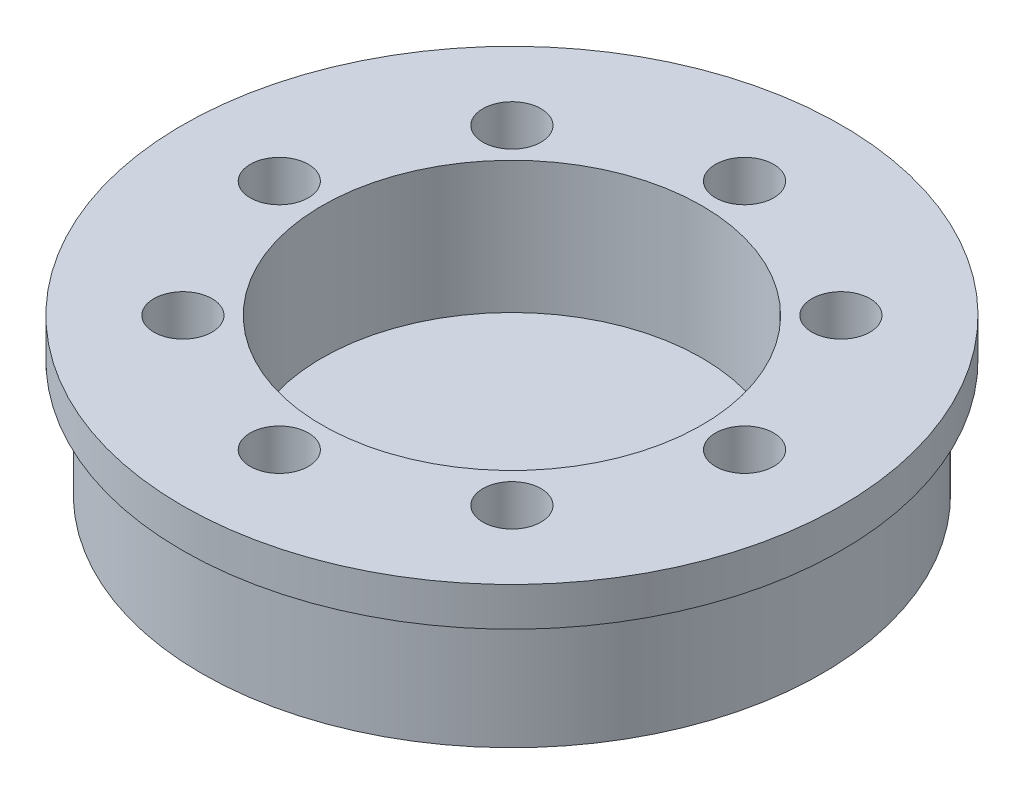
from build123d import *

# Parameters (mm, degrees)
SKETCH1_R           = 50.8
SKETCH1_R_2         = 31.115
SKETCH1_R_3         = 4.7625
BOSS_EXTRUDE1_DEPTH = 19.05
SKETCH3_R           = 32.059133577
BOSS_EXTRUDE3_DEPTH = 3.81
SKETCH2_R           = 53.975
SKETCH2_R_2         = 4.7625
SKETCH2_R_3         = 31.115
BOSS_EXTRUDE4_DEPTH = 6.35


with BuildPart() as part:
    # Sketch1 → Boss-Extrude1 (new body)
    with BuildSketch(Plane(origin=(0, 0, 0), x_dir=(1, 0, 0), z_dir=(0, 1, 0))):
        with Locations(Location((0, 0, 0), (0, 0, 90))):
            Circle(SKETCH1_R)
        with Locations(Location((0, 0, 0), (0, 0, 90))):
            Circle(SKETCH1_R_2, mode=Mode.SUBTRACT)
        with Locations(Location((0, 38.1, 0), (0, 0, 90))):
            Circle(SKETCH1_R_3, mode=Mode.SUBTRACT)
        with Locations(Location((26.940768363, 26.940768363, 0), (0, 0, 90))):
            Circle(SKETCH1_R_3, mode=Mode.SUBTRACT)
        with Locations(Location((38.1, 0, 0), (0, 0, 90))):
            Circle(SKETCH1_R_3, mode=Mode.SUBTRACT)
        with Locations(Location((26.940768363, -26.940768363, 0), (0, 0, 90))):
            Circle(SKETCH1_R_3, mode=Mode.SUBTRACT)
        with Locations(Location((0, -38.1, 0), (0, 0, 90))):
            Circle(SKETCH1_R_3, mode=Mode.SUBTRACT)
        with Locations(Location((-26.940768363, -26.940768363, 0), (0, 0, 90))):
            Circle(SKETCH1_R_3, mode=Mode.SUBTRACT)
        with Locations(Location((-38.1, 0, 0), (0, 0, 90))):
            Circle(SKETCH1_R_3, mode=Mode.SUBTRACT)
        with Locations(Location((-26.940768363, 26.940768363, 0), (0, 0, 90))):
            Circle(SKETCH1_R_3, mode=Mode.SUBTRACT)
    extrude(amount=BOSS_EXTRUDE1_DEPTH)

    # Sketch3 → Boss-Extrude3 (add)
    with BuildSketch(Plane(origin=(0, 0, 0), x_dir=(-1, 0, 0), z_dir=(0, -1, 0))):
        Circle(SKETCH3_R)
    extrude(amount=-BOSS_EXTRUDE3_DEPTH)

    # Sketch2 → Boss-Extrude4 (add)
    with BuildSketch(Plane(origin=(0, 19.05, 0), x_dir=(1, 0, 0), z_dir=(0, 1, 0))):
        with Locations(Location((0, 0, 0), (0, 0, 270))):
            Circle(SKETCH2_R)
        with Locations(Location((0, 38.1, 0), (0, 0, 90))):
            Circle(SKETCH2_R_2, mode=Mode.SUBTRACT)
        with Locations(Location((-26.940768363, 26.940768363, 0), (0, 0, 90))):
            Circle(SKETCH2_R_2, mode=Mode.SUBTRACT)
        with Locations(Location((-38.1, 0, 0), (0, 0, 90))):
            Circle(SKETCH2_R_2, mode=Mode.SUBTRACT)
        with Locations(Location((-26.940768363, -26.940768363, 0), (0, 0, 90))):
            Circle(SKETCH2_R_2, mode=Mode.SUBTRACT)
        with Locations(Location((0, -38.1, 0), (0, 0, 90))):
            Circle(SKETCH2_R_2, mode=Mode.SUBTRACT)
        with Locations(Location((26.940768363, -26.940768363, 0), (0, 0, 90))):
            Circle(SKETCH2_R_2, mode=Mode.SUBTRACT)
        with Locations(Location((38.1, 0, 0), (0, 0, 90))):
            Circle(SKETCH2_R_2, mode=Mode.SUBTRACT)
        with Locations(Location((26.940768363, 26.940768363, 0), (0, 0, 90))):
            Circle(SKETCH2_R_2, mode=Mode.SUBTRACT)
        with Locations(Location((0, 0, 0), (0, 0, 90))):
            Circle(SKETCH2_R_3, mode=Mode.SUBTRACT)
    extrude(amount=BOSS_EXTRUDE4_DEPTH)


solid = part.part
